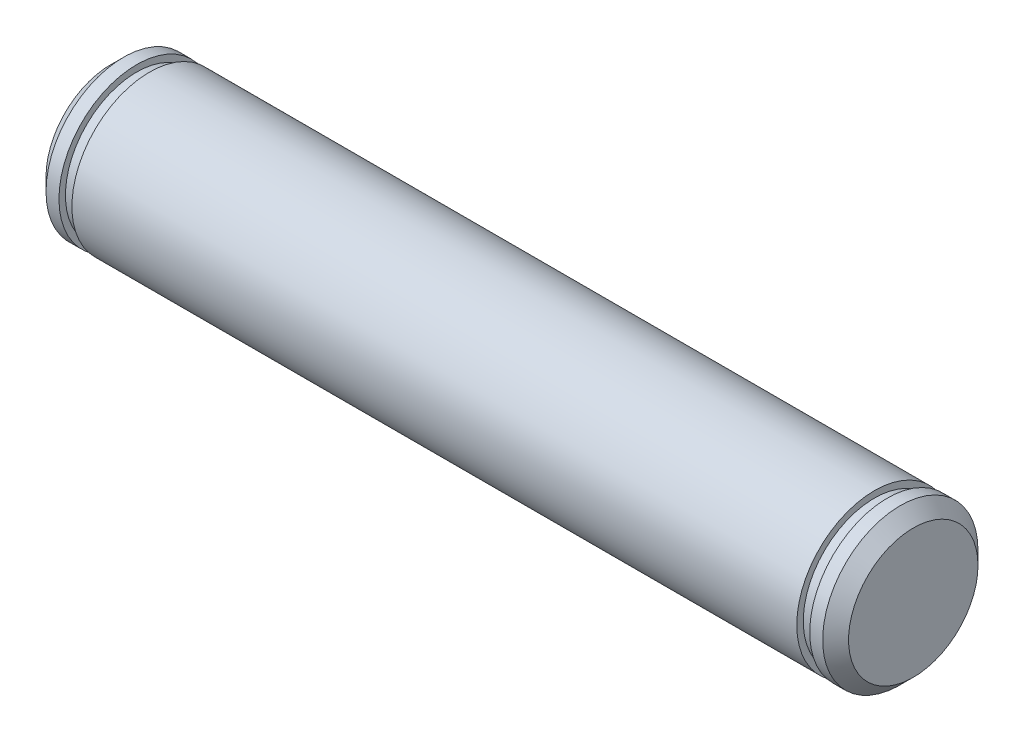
from build123d import *

# Parameters (mm, degrees)
ESQUISSE1_W     = 62
ESQUISSE1_H     = 6
CHANFREIN1_SIZE = 1
ESQUISSE2_W     = 1
ESQUISSE2_H     = 4.5
ESQUISSE3_W     = 1
ESQUISSE3_H     = 4.5


with BuildPart() as part:
    # Esquisse1 → Base-R_volution (revolve)
    with BuildSketch(Plane.XY, mode=Mode.PRIVATE) as base_r_volution_sk:
        with Locations((-31, 3)):
            Rectangle(ESQUISSE1_W, ESQUISSE1_H)
    revolve(base_r_volution_sk.sketch.rotate(Axis((40, 0, 0), (-1, 0, 0)), 90), axis=Axis((40, 0, 0), (-1, 0, 0)))

    # Chanfrein1
    chanfrein1_edges = [part.edges().sort_by_distance(p)[0] for p in [
        (-62, 0, 6),
        (0, 0, 6),
    ]]
    chamfer(chanfrein1_edges, length=CHANFREIN1_SIZE)

    # Esquisse2 → Enl_vement de mati_re-R_volution1 (revolve, cut)
    with BuildSketch(Plane.XY, mode=Mode.PRIVATE) as enl_vement_de_mati_re_r_volution1_sk:
        with Locations((-2.5, 7.75)):
            Rectangle(ESQUISSE2_W, ESQUISSE2_H)
    revolve(enl_vement_de_mati_re_r_volution1_sk.sketch.rotate(Axis((0, 0, 0), (-1, 0, 0)), 90), axis=Axis((0, 0, 0), (-1, 0, 0)), mode=Mode.SUBTRACT)

    # Esquisse3 → Enl_vement de mati_re-R_volution2 (revolve, cut)
    with BuildSketch(Plane.XY, mode=Mode.PRIVATE) as enl_vement_de_mati_re_r_volution2_sk:
        with Locations((-59.5, 7.75)):
            Rectangle(ESQUISSE3_W, ESQUISSE3_H)
    revolve(enl_vement_de_mati_re_r_volution2_sk.sketch.rotate(Axis((0, 0, 0), (-1, 0, 0)), 90), axis=Axis((0, 0, 0), (-1, 0, 0)), mode=Mode.SUBTRACT)


solid = part.part
